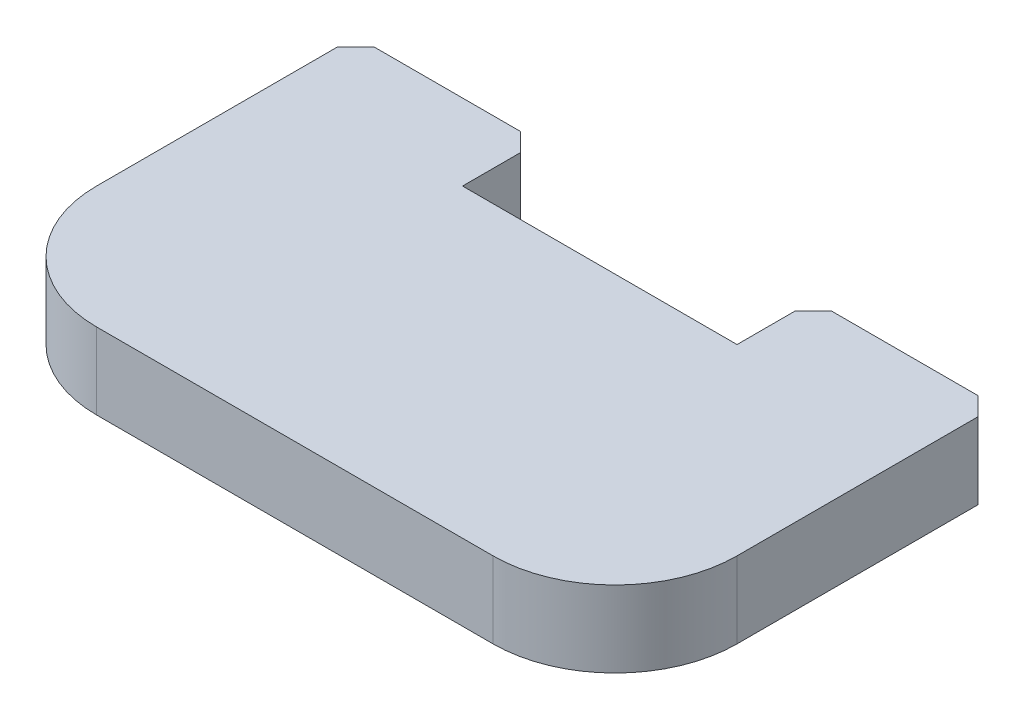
ISO-10303-21;
HEADER;
FILE_DESCRIPTION(('STEP AP214'),'2;1');
FILE_NAME('part.step','',(''),(''),'','','');
FILE_SCHEMA(('AUTOMOTIVE_DESIGN { 1 0 10303 214 1 1 1 1 }'));
ENDSEC;
DATA;
#1=APPLICATION_CONTEXT('core data for automotive mechanical design processes');
#2=APPLICATION_PROTOCOL_DEFINITION('international standard','automotive_design',2000,#1);
#3=PRODUCT_CONTEXT('',#1,'mechanical');
#4=PRODUCT('Part','Part','',(#3));
#5=PRODUCT_RELATED_PRODUCT_CATEGORY('part','',(#4));
#6=PRODUCT_DEFINITION_FORMATION('','',#4);
#7=PRODUCT_DEFINITION_CONTEXT('part definition',#1,'design');
#8=PRODUCT_DEFINITION('design','',#6,#7);
#9=PRODUCT_DEFINITION_SHAPE('','',#8);
#10=(LENGTH_UNIT() NAMED_UNIT(*) SI_UNIT(.MILLI.,.METRE.));
#11=(NAMED_UNIT(*) PLANE_ANGLE_UNIT() SI_UNIT($,.RADIAN.));
#12=(NAMED_UNIT(*) SI_UNIT($,.STERADIAN.) SOLID_ANGLE_UNIT());
#13=UNCERTAINTY_MEASURE_WITH_UNIT(LENGTH_MEASURE(1.E-05),#10,'distance_accuracy_value','');
#14=(GEOMETRIC_REPRESENTATION_CONTEXT(3) GLOBAL_UNCERTAINTY_ASSIGNED_CONTEXT((#13)) GLOBAL_UNIT_ASSIGNED_CONTEXT((#10,
#11,#12)) REPRESENTATION_CONTEXT('',''));
#15=CARTESIAN_POINT('',(0.,0.,0.));
#16=DIRECTION('',(0.,0.,1.));
#17=DIRECTION('',(1.,0.,0.));
#18=AXIS2_PLACEMENT_3D('',#15,#16,#17);
#19=CARTESIAN_POINT('',(-13.335,3.175,-7.9375));
#20=DIRECTION('',(0.,0.,1.));
#21=DIRECTION('',(1.,0.,0.));
#22=AXIS2_PLACEMENT_3D('',#19,#20,#21);
#23=PLANE('',#22);
#24=DIRECTION('',(-1.,0.,0.));
#25=VECTOR('',#24,1.);
#26=CARTESIAN_POINT('',(-13.335,3.175,-7.9375));
#27=LINE('',#26,#25);
#28=CARTESIAN_POINT('',(12.573,3.175,-7.9375));
#29=VERTEX_POINT('',#28);
#30=CARTESIAN_POINT('',(6.477,3.175,-7.9375));
#31=VERTEX_POINT('',#30);
#32=EDGE_CURVE('E197',#29,#31,#27,.T.);
#33=ORIENTED_EDGE('',*,*,#32,.F.);
#34=DIRECTION('',(0.,-1.,0.));
#35=VECTOR('',#34,1.);
#36=CARTESIAN_POINT('',(12.573,3.175,-7.9375));
#37=LINE('',#36,#35);
#38=CARTESIAN_POINT('',(12.573,0.,-7.9375));
#39=VERTEX_POINT('',#38);
#40=EDGE_CURVE('E222',#29,#39,#37,.T.);
#41=ORIENTED_EDGE('',*,*,#40,.T.);
#42=DIRECTION('',(-1.,0.,0.));
#43=VECTOR('',#42,1.);
#44=CARTESIAN_POINT('',(-13.335,0.,-7.9375));
#45=LINE('',#44,#43);
#46=CARTESIAN_POINT('',(6.477,0.,-7.9375));
#47=VERTEX_POINT('',#46);
#48=EDGE_CURVE('E210',#39,#47,#45,.T.);
#49=ORIENTED_EDGE('',*,*,#48,.T.);
#50=DIRECTION('',(0.,1.,0.));
#51=VECTOR('',#50,1.);
#52=CARTESIAN_POINT('',(6.477,3.175,-7.9375));
#53=LINE('',#52,#51);
#54=EDGE_CURVE('E218',#47,#31,#53,.T.);
#55=ORIENTED_EDGE('',*,*,#54,.T.);
#56=EDGE_LOOP('',(#33,#41,#49,#55));
#57=FACE_BOUND('',#56,.T.);
#58=ADVANCED_FACE('F43',(#57),#23,.F.);
#59=CARTESIAN_POINT('',(13.335,3.175,-7.9375));
#60=DIRECTION('',(-1.,0.,0.));
#61=DIRECTION('',(0.,0.,1.));
#62=AXIS2_PLACEMENT_3D('',#59,#60,#61);
#63=PLANE('',#62);
#64=DIRECTION('',(0.,0.,-1.));
#65=VECTOR('',#64,1.);
#66=CARTESIAN_POINT('',(13.335,3.175,-7.9375));
#67=LINE('',#66,#65);
#68=CARTESIAN_POINT('',(13.335,3.175,2.8575));
#69=VERTEX_POINT('',#68);
#70=CARTESIAN_POINT('',(13.335,3.175,-7.1755));
#71=VERTEX_POINT('',#70);
#72=EDGE_CURVE('E189',#69,#71,#67,.T.);
#73=ORIENTED_EDGE('',*,*,#72,.F.);
#74=DIRECTION('',(0.,-1.,0.));
#75=VECTOR('',#74,1.);
#76=CARTESIAN_POINT('',(13.335,3.175,2.8575));
#77=LINE('',#76,#75);
#78=CARTESIAN_POINT('',(13.335,0.,2.8575));
#79=VERTEX_POINT('',#78);
#80=EDGE_CURVE('E271',#69,#79,#77,.T.);
#81=ORIENTED_EDGE('',*,*,#80,.T.);
#82=DIRECTION('',(0.,0.,-1.));
#83=VECTOR('',#82,1.);
#84=CARTESIAN_POINT('',(13.335,0.,-7.9375));
#85=LINE('',#84,#83);
#86=CARTESIAN_POINT('',(13.335,0.,-7.1755));
#87=VERTEX_POINT('',#86);
#88=EDGE_CURVE('E160',#79,#87,#85,.T.);
#89=ORIENTED_EDGE('',*,*,#88,.T.);
#90=DIRECTION('',(0.,1.,0.));
#91=VECTOR('',#90,1.);
#92=CARTESIAN_POINT('',(13.335,3.175,-7.1755));
#93=LINE('',#92,#91);
#94=EDGE_CURVE('E239',#87,#71,#93,.T.);
#95=ORIENTED_EDGE('',*,*,#94,.T.);
#96=EDGE_LOOP('',(#73,#81,#89,#95));
#97=FACE_BOUND('',#96,.T.);
#98=ADVANCED_FACE('F297',(#97),#63,.F.);
#99=CARTESIAN_POINT('',(-6.477,0.,-7.9375));
#100=VERTEX_POINT('',#99);
#101=CARTESIAN_POINT('',(-12.573,0.,-7.9375));
#102=VERTEX_POINT('',#101);
#103=EDGE_CURVE('E206',#100,#102,#45,.T.);
#104=ORIENTED_EDGE('',*,*,#103,.T.);
#105=DIRECTION('',(0.,1.,0.));
#106=VECTOR('',#105,1.);
#107=CARTESIAN_POINT('',(-12.573,3.175,-7.9375));
#108=LINE('',#107,#106);
#109=CARTESIAN_POINT('',(-12.573,3.175,-7.9375));
#110=VERTEX_POINT('',#109);
#111=EDGE_CURVE('E265',#102,#110,#108,.T.);
#112=ORIENTED_EDGE('',*,*,#111,.T.);
#113=CARTESIAN_POINT('',(-6.477,3.175,-7.9375));
#114=VERTEX_POINT('',#113);
#115=EDGE_CURVE('E192',#114,#110,#27,.T.);
#116=ORIENTED_EDGE('',*,*,#115,.F.);
#117=DIRECTION('',(0.,-1.,0.));
#118=VECTOR('',#117,1.);
#119=CARTESIAN_POINT('',(-6.477,3.175,-7.9375));
#120=LINE('',#119,#118);
#121=EDGE_CURVE('E261',#114,#100,#120,.T.);
#122=ORIENTED_EDGE('',*,*,#121,.T.);
#123=EDGE_LOOP('',(#104,#112,#116,#122));
#124=FACE_BOUND('',#123,.T.);
#125=ADVANCED_FACE('F315',(#124),#23,.F.);
#126=CARTESIAN_POINT('',(-13.335,3.175,-7.9375));
#127=DIRECTION('',(1.,0.,0.));
#128=DIRECTION('',(0.,0.,-1.));
#129=AXIS2_PLACEMENT_3D('',#126,#127,#128);
#130=PLANE('',#129);
#131=DIRECTION('',(0.,0.,1.));
#132=VECTOR('',#131,1.);
#133=CARTESIAN_POINT('',(-13.335,0.,-7.9375));
#134=LINE('',#133,#132);
#135=CARTESIAN_POINT('',(-13.335,0.,-7.1755));
#136=VERTEX_POINT('',#135);
#137=CARTESIAN_POINT('',(-13.335,0.,2.8575));
#138=VERTEX_POINT('',#137);
#139=EDGE_CURVE('E211',#136,#138,#134,.T.);
#140=ORIENTED_EDGE('',*,*,#139,.T.);
#141=DIRECTION('',(0.,-1.,0.));
#142=VECTOR('',#141,1.);
#143=CARTESIAN_POINT('',(-13.335,3.175,2.8575));
#144=LINE('',#143,#142);
#145=CARTESIAN_POINT('',(-13.335,3.175,2.8575));
#146=VERTEX_POINT('',#145);
#147=EDGE_CURVE('E11',#138,#146,#144,.F.);
#148=ORIENTED_EDGE('',*,*,#147,.T.);
#149=DIRECTION('',(0.,0.,1.));
#150=VECTOR('',#149,1.);
#151=CARTESIAN_POINT('',(-13.335,3.175,-7.9375));
#152=LINE('',#151,#150);
#153=CARTESIAN_POINT('',(-13.335,3.175,-7.1755));
#154=VERTEX_POINT('',#153);
#155=EDGE_CURVE('E198',#154,#146,#152,.T.);
#156=ORIENTED_EDGE('',*,*,#155,.F.);
#157=DIRECTION('',(0.,-1.,0.));
#158=VECTOR('',#157,1.);
#159=CARTESIAN_POINT('',(-13.335,3.175,-7.1755));
#160=LINE('',#159,#158);
#161=EDGE_CURVE('E257',#154,#136,#160,.T.);
#162=ORIENTED_EDGE('',*,*,#161,.T.);
#163=EDGE_LOOP('',(#140,#148,#156,#162));
#164=FACE_BOUND('',#163,.T.);
#165=ADVANCED_FACE('F307',(#164),#130,.F.);
#166=CARTESIAN_POINT('',(-13.335,3.175,7.9375));
#167=DIRECTION('',(0.,0.,-1.));
#168=DIRECTION('',(-1.,0.,0.));
#169=AXIS2_PLACEMENT_3D('',#166,#167,#168);
#170=PLANE('',#169);
#171=DIRECTION('',(1.,0.,0.));
#172=VECTOR('',#171,1.);
#173=CARTESIAN_POINT('',(-13.335,0.,7.9375));
#174=LINE('',#173,#172);
#175=CARTESIAN_POINT('',(-8.255,0.,7.9375));
#176=VERTEX_POINT('',#175);
#177=CARTESIAN_POINT('',(8.255,0.,7.9375));
#178=VERTEX_POINT('',#177);
#179=EDGE_CURVE('E193',#176,#178,#174,.T.);
#180=ORIENTED_EDGE('',*,*,#179,.T.);
#181=DIRECTION('',(0.,-1.,0.));
#182=VECTOR('',#181,1.);
#183=CARTESIAN_POINT('',(8.255,3.175,7.9375));
#184=LINE('',#183,#182);
#185=CARTESIAN_POINT('',(8.255,3.175,7.9375));
#186=VERTEX_POINT('',#185);
#187=EDGE_CURVE('E65',#178,#186,#184,.F.);
#188=ORIENTED_EDGE('',*,*,#187,.T.);
#189=DIRECTION('',(1.,0.,0.));
#190=VECTOR('',#189,1.);
#191=CARTESIAN_POINT('',(-13.335,3.175,7.9375));
#192=LINE('',#191,#190);
#193=CARTESIAN_POINT('',(-8.255,3.175,7.9375));
#194=VERTEX_POINT('',#193);
#195=EDGE_CURVE('E201',#194,#186,#192,.T.);
#196=ORIENTED_EDGE('',*,*,#195,.F.);
#197=DIRECTION('',(0.,-1.,0.));
#198=VECTOR('',#197,1.);
#199=CARTESIAN_POINT('',(-8.255,3.175,7.9375));
#200=LINE('',#199,#198);
#201=EDGE_CURVE('E281',#194,#176,#200,.T.);
#202=ORIENTED_EDGE('',*,*,#201,.T.);
#203=EDGE_LOOP('',(#180,#188,#196,#202));
#204=FACE_BOUND('',#203,.T.);
#205=ADVANCED_FACE('F302',(#204),#170,.F.);
#206=CARTESIAN_POINT('',(0.,3.175,0.));
#207=DIRECTION('',(0.,1.,0.));
#208=DIRECTION('',(0.,0.,1.));
#209=AXIS2_PLACEMENT_3D('',#206,#207,#208);
#210=PLANE('',#209);
#211=ORIENTED_EDGE('',*,*,#195,.T.);
#212=CARTESIAN_POINT('',(8.255,3.175,2.8575));
#213=DIRECTION('',(0.,1.,0.));
#214=DIRECTION('',(0.,0.,1.));
#215=AXIS2_PLACEMENT_3D('',#212,#213,#214);
#216=CIRCLE('',#215,5.08);
#217=EDGE_CURVE('E52',#186,#69,#216,.T.);
#218=ORIENTED_EDGE('',*,*,#217,.T.);
#219=ORIENTED_EDGE('',*,*,#72,.T.);
#220=DIRECTION('',(0.707106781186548,0.,0.707106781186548));
#221=VECTOR('',#220,1.);
#222=CARTESIAN_POINT('',(10.25525,3.175,-10.25525));
#223=LINE('',#222,#221);
#224=EDGE_CURVE('E252',#71,#29,#223,.F.);
#225=ORIENTED_EDGE('',*,*,#224,.T.);
#226=ORIENTED_EDGE('',*,*,#32,.T.);
#227=DIRECTION('',(0.707106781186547,0.,-0.707106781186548));
#228=VECTOR('',#227,1.);
#229=CARTESIAN_POINT('',(-0.730249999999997,3.175,-0.730249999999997));
#230=LINE('',#229,#228);
#231=CARTESIAN_POINT('',(5.715,3.175,-7.1755));
#232=VERTEX_POINT('',#231);
#233=EDGE_CURVE('E249',#31,#232,#230,.F.);
#234=ORIENTED_EDGE('',*,*,#233,.T.);
#235=DIRECTION('',(0.,0.,-1.));
#236=VECTOR('',#235,1.);
#237=CARTESIAN_POINT('',(5.715,3.175,-11.1125));
#238=LINE('',#237,#236);
#239=CARTESIAN_POINT('',(5.715,3.175,-4.7625));
#240=VERTEX_POINT('',#239);
#241=EDGE_CURVE('E181',#240,#232,#238,.T.);
#242=ORIENTED_EDGE('',*,*,#241,.F.);
#243=DIRECTION('',(1.,0.,0.));
#244=VECTOR('',#243,1.);
#245=CARTESIAN_POINT('',(-5.715,3.175,-4.7625));
#246=LINE('',#245,#244);
#247=CARTESIAN_POINT('',(-5.715,3.175,-4.7625));
#248=VERTEX_POINT('',#247);
#249=EDGE_CURVE('E155',#248,#240,#246,.T.);
#250=ORIENTED_EDGE('',*,*,#249,.F.);
#251=DIRECTION('',(0.,0.,1.));
#252=VECTOR('',#251,1.);
#253=CARTESIAN_POINT('',(-5.715,3.175,-11.1125));
#254=LINE('',#253,#252);
#255=CARTESIAN_POINT('',(-5.715,3.175,-7.1755));
#256=VERTEX_POINT('',#255);
#257=EDGE_CURVE('E184',#256,#248,#254,.T.);
#258=ORIENTED_EDGE('',*,*,#257,.F.);
#259=DIRECTION('',(0.707106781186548,0.,0.707106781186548));
#260=VECTOR('',#259,1.);
#261=CARTESIAN_POINT('',(0.730250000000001,3.175,-0.730250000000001));
#262=LINE('',#261,#260);
#263=EDGE_CURVE('E243',#256,#114,#262,.F.);
#264=ORIENTED_EDGE('',*,*,#263,.T.);
#265=ORIENTED_EDGE('',*,*,#115,.T.);
#266=DIRECTION('',(0.707106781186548,0.,-0.707106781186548));
#267=VECTOR('',#266,1.);
#268=CARTESIAN_POINT('',(-10.25525,3.175,-10.25525));
#269=LINE('',#268,#267);
#270=EDGE_CURVE('E246',#110,#154,#269,.F.);
#271=ORIENTED_EDGE('',*,*,#270,.T.);
#272=ORIENTED_EDGE('',*,*,#155,.T.);
#273=CARTESIAN_POINT('',(-8.255,3.175,2.8575));
#274=DIRECTION('',(0.,1.,0.));
#275=DIRECTION('',(0.,0.,1.));
#276=AXIS2_PLACEMENT_3D('',#273,#274,#275);
#277=CIRCLE('',#276,5.08);
#278=EDGE_CURVE('E287',#146,#194,#277,.T.);
#279=ORIENTED_EDGE('',*,*,#278,.T.);
#280=EDGE_LOOP('',(#211,#218,#219,#225,#226,#234,#242,#250,#258,#264,#265,#271,#272,#279));
#281=FACE_BOUND('',#280,.T.);
#282=ADVANCED_FACE('F293',(#281),#210,.T.);
#283=CARTESIAN_POINT('',(0.,0.,0.));
#284=DIRECTION('',(0.,1.,0.));
#285=DIRECTION('',(0.,0.,1.));
#286=AXIS2_PLACEMENT_3D('',#283,#284,#285);
#287=PLANE('',#286);
#288=ORIENTED_EDGE('',*,*,#88,.F.);
#289=CARTESIAN_POINT('',(8.255,0.,2.8575));
#290=DIRECTION('',(0.,1.,0.));
#291=DIRECTION('',(0.,0.,1.));
#292=AXIS2_PLACEMENT_3D('',#289,#290,#291);
#293=CIRCLE('',#292,5.08);
#294=EDGE_CURVE('E278',#79,#178,#293,.F.);
#295=ORIENTED_EDGE('',*,*,#294,.T.);
#296=ORIENTED_EDGE('',*,*,#179,.F.);
#297=CARTESIAN_POINT('',(-8.255,0.,2.8575));
#298=DIRECTION('',(0.,1.,0.));
#299=DIRECTION('',(0.,0.,1.));
#300=AXIS2_PLACEMENT_3D('',#297,#298,#299);
#301=CIRCLE('',#300,5.08);
#302=EDGE_CURVE('E275',#176,#138,#301,.F.);
#303=ORIENTED_EDGE('',*,*,#302,.T.);
#304=ORIENTED_EDGE('',*,*,#139,.F.);
#305=DIRECTION('',(-0.707106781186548,0.,0.707106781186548));
#306=VECTOR('',#305,1.);
#307=CARTESIAN_POINT('',(-13.335,0.,-7.1755));
#308=LINE('',#307,#306);
#309=EDGE_CURVE('E229',#136,#102,#308,.F.);
#310=ORIENTED_EDGE('',*,*,#309,.T.);
#311=ORIENTED_EDGE('',*,*,#103,.F.);
#312=DIRECTION('',(-0.707106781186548,0.,-0.707106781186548));
#313=VECTOR('',#312,1.);
#314=CARTESIAN_POINT('',(-6.477,0.,-7.9375));
#315=LINE('',#314,#313);
#316=CARTESIAN_POINT('',(-5.715,0.,-7.1755));
#317=VERTEX_POINT('',#316);
#318=EDGE_CURVE('E226',#100,#317,#315,.F.);
#319=ORIENTED_EDGE('',*,*,#318,.T.);
#320=DIRECTION('',(0.,0.,1.));
#321=VECTOR('',#320,1.);
#322=CARTESIAN_POINT('',(-5.715,0.,0.));
#323=LINE('',#322,#321);
#324=CARTESIAN_POINT('',(-5.715,0.,-4.7625));
#325=VERTEX_POINT('',#324);
#326=EDGE_CURVE('E175',#317,#325,#323,.T.);
#327=ORIENTED_EDGE('',*,*,#326,.T.);
#328=DIRECTION('',(1.,0.,0.));
#329=VECTOR('',#328,1.);
#330=CARTESIAN_POINT('',(-5.715,0.,-4.7625));
#331=LINE('',#330,#329);
#332=CARTESIAN_POINT('',(5.715,0.,-4.7625));
#333=VERTEX_POINT('',#332);
#334=EDGE_CURVE('E152',#325,#333,#331,.T.);
#335=ORIENTED_EDGE('',*,*,#334,.T.);
#336=DIRECTION('',(0.,0.,-1.));
#337=VECTOR('',#336,1.);
#338=CARTESIAN_POINT('',(5.715,0.,-11.1125));
#339=LINE('',#338,#337);
#340=CARTESIAN_POINT('',(5.715,0.,-7.1755));
#341=VERTEX_POINT('',#340);
#342=EDGE_CURVE('E164',#333,#341,#339,.T.);
#343=ORIENTED_EDGE('',*,*,#342,.T.);
#344=DIRECTION('',(-0.707106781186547,0.,0.707106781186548));
#345=VECTOR('',#344,1.);
#346=CARTESIAN_POINT('',(6.477,0.,-7.9375));
#347=LINE('',#346,#345);
#348=EDGE_CURVE('E232',#341,#47,#347,.F.);
#349=ORIENTED_EDGE('',*,*,#348,.T.);
#350=ORIENTED_EDGE('',*,*,#48,.F.);
#351=DIRECTION('',(-0.707106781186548,0.,-0.707106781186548));
#352=VECTOR('',#351,1.);
#353=CARTESIAN_POINT('',(12.573,0.,-7.9375));
#354=LINE('',#353,#352);
#355=EDGE_CURVE('E235',#39,#87,#354,.F.);
#356=ORIENTED_EDGE('',*,*,#355,.T.);
#357=EDGE_LOOP('',(#288,#295,#296,#303,#304,#310,#311,#319,#327,#335,#343,#349,#350,#356));
#358=FACE_BOUND('',#357,.T.);
#359=ADVANCED_FACE('F173',(#358),#287,.F.);
#360=CARTESIAN_POINT('',(5.715,0.,-11.1125));
#361=DIRECTION('',(1.,0.,0.));
#362=DIRECTION('',(0.,0.,-1.));
#363=AXIS2_PLACEMENT_3D('',#360,#361,#362);
#364=PLANE('',#363);
#365=ORIENTED_EDGE('',*,*,#241,.T.);
#366=DIRECTION('',(0.,-1.,0.));
#367=VECTOR('',#366,1.);
#368=CARTESIAN_POINT('',(5.715,0.,-7.1755));
#369=LINE('',#368,#367);
#370=EDGE_CURVE('E167',#232,#341,#369,.T.);
#371=ORIENTED_EDGE('',*,*,#370,.T.);
#372=ORIENTED_EDGE('',*,*,#342,.F.);
#373=DIRECTION('',(0.,1.,0.));
#374=VECTOR('',#373,1.);
#375=CARTESIAN_POINT('',(5.715,0.,-4.7625));
#376=LINE('',#375,#374);
#377=EDGE_CURVE('E147',#333,#240,#376,.T.);
#378=ORIENTED_EDGE('',*,*,#377,.T.);
#379=EDGE_LOOP('',(#365,#371,#372,#378));
#380=FACE_BOUND('',#379,.T.);
#381=ADVANCED_FACE('F165',(#380),#364,.F.);
#382=CARTESIAN_POINT('',(-5.715,0.,-11.1125));
#383=DIRECTION('',(-1.,0.,0.));
#384=DIRECTION('',(0.,0.,1.));
#385=AXIS2_PLACEMENT_3D('',#382,#383,#384);
#386=PLANE('',#385);
#387=ORIENTED_EDGE('',*,*,#326,.F.);
#388=DIRECTION('',(0.,1.,0.));
#389=VECTOR('',#388,1.);
#390=CARTESIAN_POINT('',(-5.715,0.,-7.1755));
#391=LINE('',#390,#389);
#392=EDGE_CURVE('E268',#317,#256,#391,.T.);
#393=ORIENTED_EDGE('',*,*,#392,.T.);
#394=ORIENTED_EDGE('',*,*,#257,.T.);
#395=DIRECTION('',(0.,1.,0.));
#396=VECTOR('',#395,1.);
#397=CARTESIAN_POINT('',(-5.715,0.,-4.7625));
#398=LINE('',#397,#396);
#399=EDGE_CURVE('E161',#325,#248,#398,.T.);
#400=ORIENTED_EDGE('',*,*,#399,.F.);
#401=EDGE_LOOP('',(#387,#393,#394,#400));
#402=FACE_BOUND('',#401,.T.);
#403=ADVANCED_FACE('F323',(#402),#386,.F.);
#404=CARTESIAN_POINT('',(-5.715,0.,-4.7625));
#405=DIRECTION('',(0.,0.,1.));
#406=DIRECTION('',(1.,0.,0.));
#407=AXIS2_PLACEMENT_3D('',#404,#405,#406);
#408=PLANE('',#407);
#409=ORIENTED_EDGE('',*,*,#249,.T.);
#410=ORIENTED_EDGE('',*,*,#377,.F.);
#411=ORIENTED_EDGE('',*,*,#334,.F.);
#412=ORIENTED_EDGE('',*,*,#399,.T.);
#413=EDGE_LOOP('',(#409,#410,#411,#412));
#414=FACE_BOUND('',#413,.T.);
#415=ADVANCED_FACE('F149',(#414),#408,.F.);
#416=CARTESIAN_POINT('',(12.573,3.175,-7.9375));
#417=DIRECTION('',(-0.707106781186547,0.,0.707106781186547));
#418=DIRECTION('',(0.,-1.,0.));
#419=AXIS2_PLACEMENT_3D('',#416,#417,#418);
#420=PLANE('',#419);
#421=ORIENTED_EDGE('',*,*,#224,.F.);
#422=ORIENTED_EDGE('',*,*,#94,.F.);
#423=ORIENTED_EDGE('',*,*,#355,.F.);
#424=ORIENTED_EDGE('',*,*,#40,.F.);
#425=EDGE_LOOP('',(#421,#422,#423,#424));
#426=FACE_BOUND('',#425,.T.);
#427=ADVANCED_FACE('F337',(#426),#420,.F.);
#428=CARTESIAN_POINT('',(6.477,3.175,-7.9375));
#429=DIRECTION('',(0.707106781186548,0.,0.707106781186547));
#430=DIRECTION('',(0.,1.,0.));
#431=AXIS2_PLACEMENT_3D('',#428,#429,#430);
#432=PLANE('',#431);
#433=ORIENTED_EDGE('',*,*,#348,.F.);
#434=ORIENTED_EDGE('',*,*,#370,.F.);
#435=ORIENTED_EDGE('',*,*,#233,.F.);
#436=ORIENTED_EDGE('',*,*,#54,.F.);
#437=EDGE_LOOP('',(#433,#434,#435,#436));
#438=FACE_BOUND('',#437,.T.);
#439=ADVANCED_FACE('F327',(#438),#432,.F.);
#440=CARTESIAN_POINT('',(-13.335,3.175,-7.1755));
#441=DIRECTION('',(0.707106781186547,0.,0.707106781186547));
#442=DIRECTION('',(0.,-1.,0.));
#443=AXIS2_PLACEMENT_3D('',#440,#441,#442);
#444=PLANE('',#443);
#445=ORIENTED_EDGE('',*,*,#270,.F.);
#446=ORIENTED_EDGE('',*,*,#111,.F.);
#447=ORIENTED_EDGE('',*,*,#309,.F.);
#448=ORIENTED_EDGE('',*,*,#161,.F.);
#449=EDGE_LOOP('',(#445,#446,#447,#448));
#450=FACE_BOUND('',#449,.T.);
#451=ADVANCED_FACE('F311',(#450),#444,.F.);
#452=CARTESIAN_POINT('',(-6.477,3.175,-7.9375));
#453=DIRECTION('',(-0.707106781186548,0.,0.707106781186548));
#454=DIRECTION('',(0.,-1.,0.));
#455=AXIS2_PLACEMENT_3D('',#452,#453,#454);
#456=PLANE('',#455);
#457=ORIENTED_EDGE('',*,*,#263,.F.);
#458=ORIENTED_EDGE('',*,*,#392,.F.);
#459=ORIENTED_EDGE('',*,*,#318,.F.);
#460=ORIENTED_EDGE('',*,*,#121,.F.);
#461=EDGE_LOOP('',(#457,#458,#459,#460));
#462=FACE_BOUND('',#461,.T.);
#463=ADVANCED_FACE('F320',(#462),#456,.F.);
#464=CARTESIAN_POINT('',(8.255,3.175,2.8575));
#465=DIRECTION('',(0.,-1.,0.));
#466=DIRECTION('',(0.,0.,-1.));
#467=AXIS2_PLACEMENT_3D('',#464,#465,#466);
#468=CYLINDRICAL_SURFACE('',#467,5.08);
#469=ORIENTED_EDGE('',*,*,#217,.F.);
#470=ORIENTED_EDGE('',*,*,#187,.F.);
#471=ORIENTED_EDGE('',*,*,#294,.F.);
#472=ORIENTED_EDGE('',*,*,#80,.F.);
#473=EDGE_LOOP('',(#469,#470,#471,#472));
#474=FACE_BOUND('',#473,.T.);
#475=ADVANCED_FACE('F300',(#474),#468,.T.);
#476=CARTESIAN_POINT('',(-8.255,3.175,2.8575));
#477=DIRECTION('',(0.,-1.,0.));
#478=DIRECTION('',(0.,0.,-1.));
#479=AXIS2_PLACEMENT_3D('',#476,#477,#478);
#480=CYLINDRICAL_SURFACE('',#479,5.08);
#481=ORIENTED_EDGE('',*,*,#278,.F.);
#482=ORIENTED_EDGE('',*,*,#147,.F.);
#483=ORIENTED_EDGE('',*,*,#302,.F.);
#484=ORIENTED_EDGE('',*,*,#201,.F.);
#485=EDGE_LOOP('',(#481,#482,#483,#484));
#486=FACE_BOUND('',#485,.T.);
#487=ADVANCED_FACE('F45',(#486),#480,.T.);
#488=CLOSED_SHELL('',(#58,#98,#125,#165,#205,#282,#359,#381,#403,#415,#427,#439,#451,#463,#475,#487));
#489=MANIFOLD_SOLID_BREP('B2',#488);
#490=ADVANCED_BREP_SHAPE_REPRESENTATION('',(#18,#489),#14);
#491=SHAPE_DEFINITION_REPRESENTATION(#9,#490);
ENDSEC;
END-ISO-10303-21;
